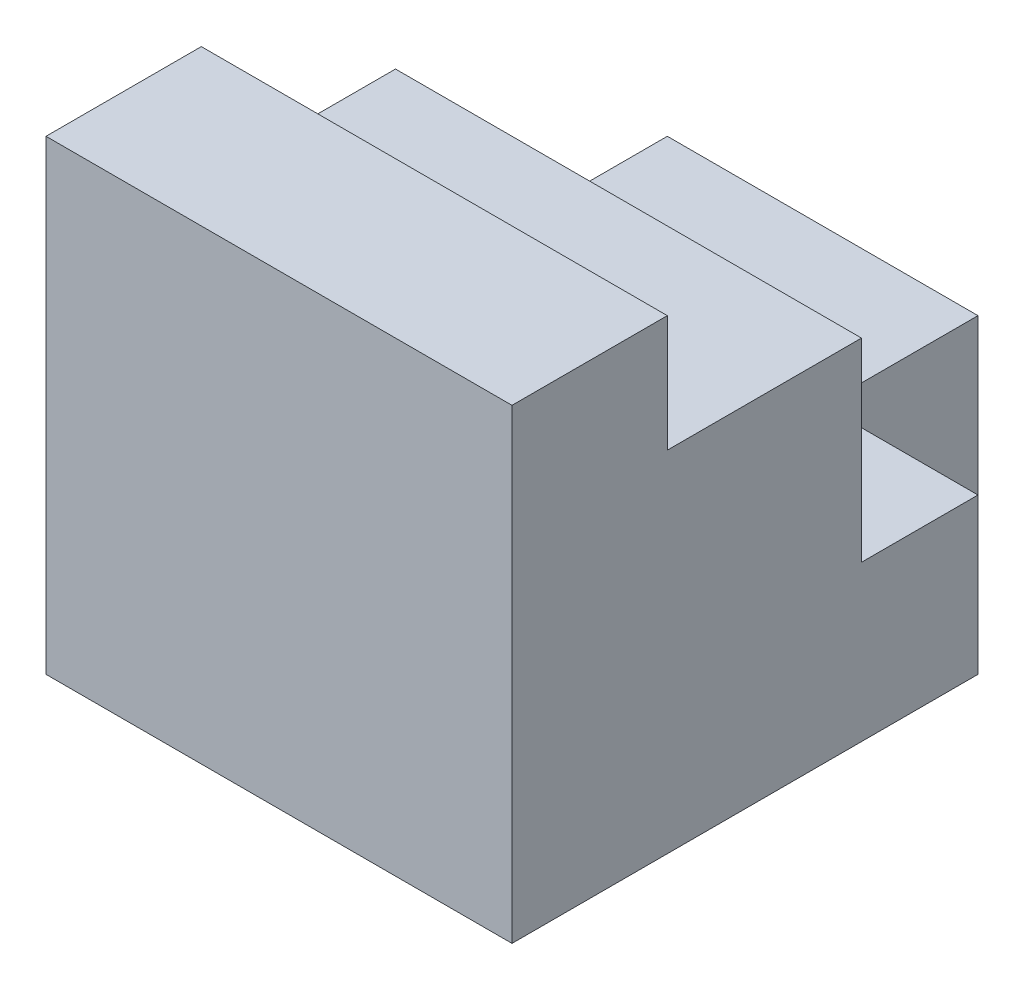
from build123d import *

# Parameters (mm, degrees)
AUFSATZ_LINEAR_AUSTRAGEN1_DEPTH = 60
SKIZZE3_W                       = 20
SKIZZE3_H                       = 20
SCHNITT_LINEAR_AUSTRAGEN1_DEPTH = 108.703296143


with BuildPart() as part:
    # Skizze1 → Aufsatz-Linear austragen1 (new body)
    with BuildSketch(Plane(origin=(0, 0, 0), x_dir=(0, 0, -1), z_dir=(1, 0, 0))):
        Polygon((0, 0), (0, 60), (20, 60), (20, 45), (45, 45), (45, 20), (80, 20), (80, 0), align=None)
    extrude(amount=AUFSATZ_LINEAR_AUSTRAGEN1_DEPTH)

    # Skizze3 → Schnitt-Linear austragen1 (cut, through all)
    with BuildSketch(Plane(origin=(0, 20, 0), x_dir=(1, 0, 0), z_dir=(0, 1, 0))):
        with Locations((50, 70)):
            Rectangle(SKIZZE3_W, SKIZZE3_H)
    extrude(amount=-SCHNITT_LINEAR_AUSTRAGEN1_DEPTH, mode=Mode.SUBTRACT)


solid = part.part
